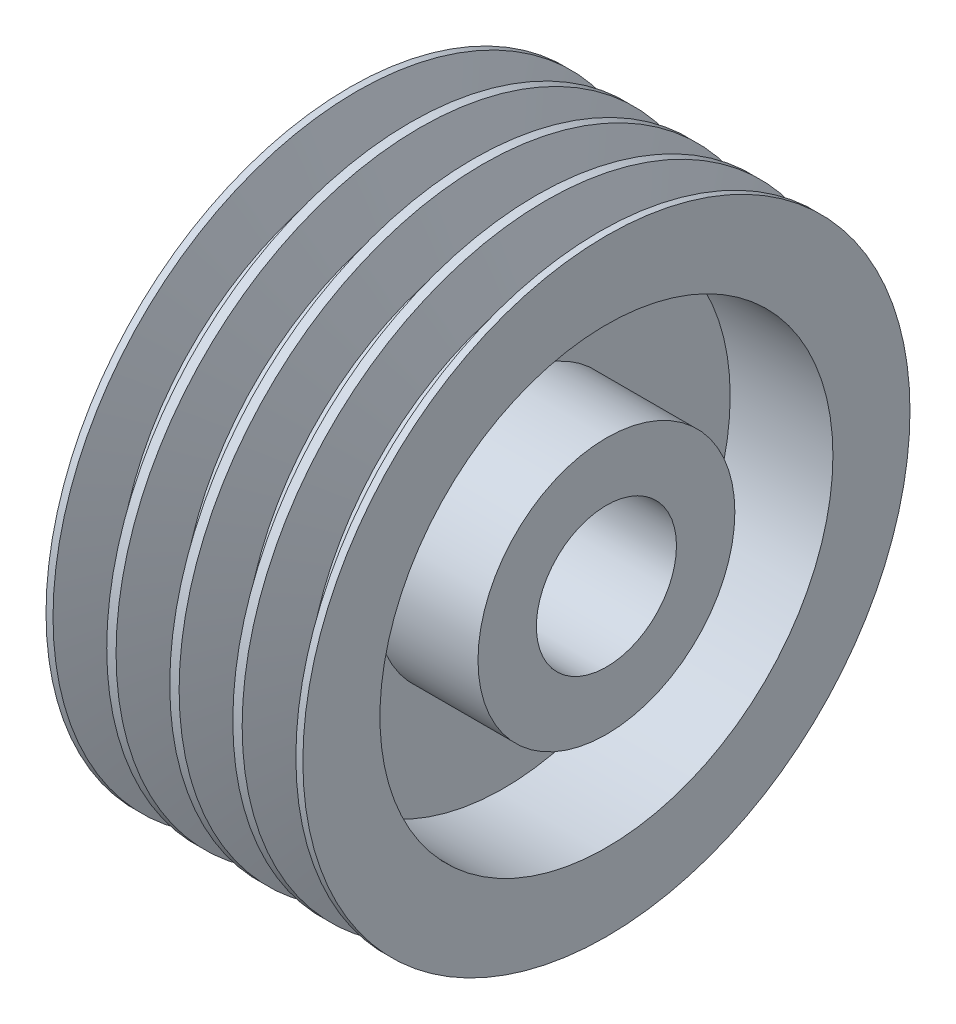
from build123d import *


with BuildPart() as part:
    # Sketch1 → Revolve1 (revolve)
    with BuildSketch(Plane.XY, mode=Mode.PRIVATE) as revolve1_sk:
        Polygon((-55, 97), (-11, 97), (-11, 55), (-55, 55), (-55, 30), (55, 30), (55, 55), (11, 55), (11, 97), (55, 97), (55, 130), (52, 130), (45.5, 109), (35.5, 109), (29, 130), (25, 130), (18.5, 109), (8.5, 109), (2, 130), (-2, 130), (-8.5, 109), (-18.5, 109), (-25, 130), (-29, 130), (-35.5, 109), (-45.5, 109), (-52, 130), (-55, 130), align=None)
    revolve(revolve1_sk.sketch.rotate(Axis((67.621145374, 0, 0), (-1, 0, 0)), 90), axis=Axis((67.621145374, 0, 0), (-1, 0, 0)))


solid = part.part
